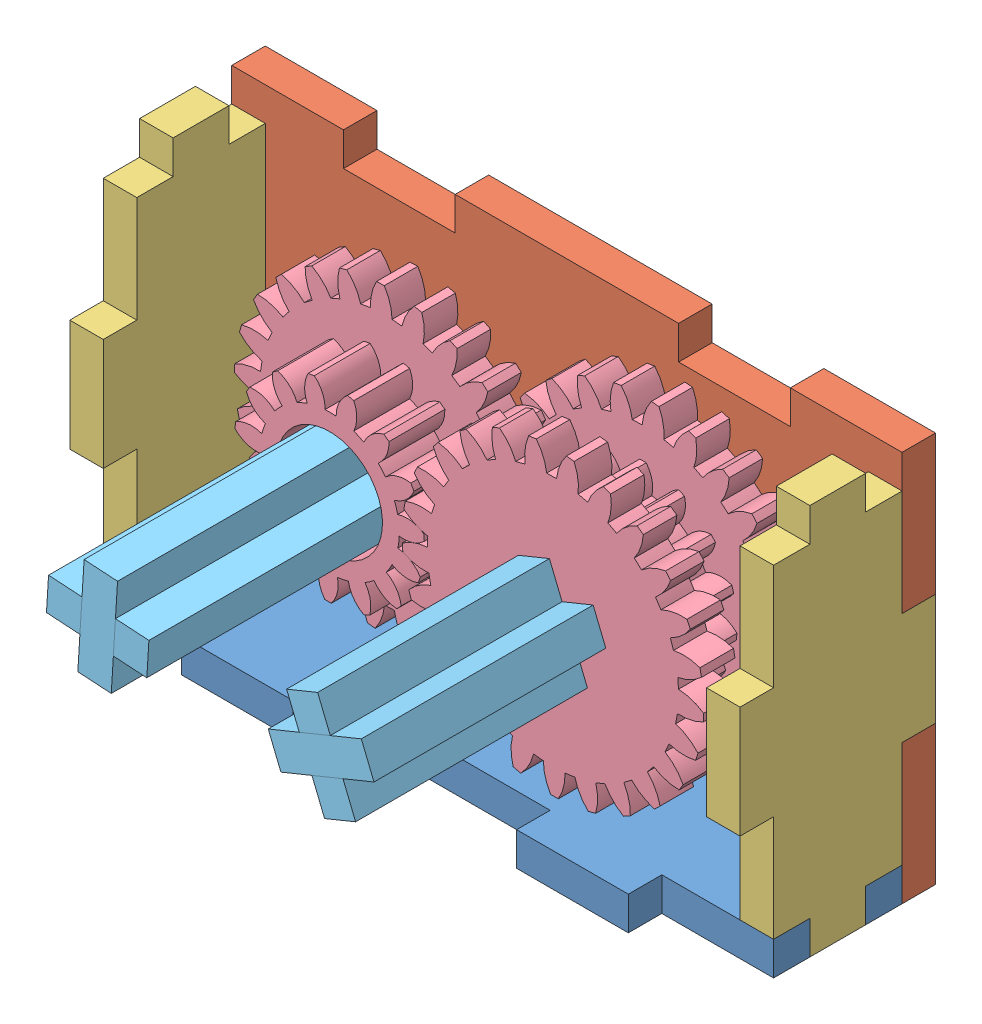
SolidWorks assembly Ensamblaje1.SLDASM, configuration Predeterminado (file format 10000). Lengths in mm.
Overall size (60 38.26 40).
18 component instances, 5 part files, 34 mates.
Components (placement in the parent):
- base-1: base.SLDPRT [Predeterminado] at (-76.0453 8.4398 111) size (60 3 17.5)
- TapaTrasera-1: TapaTrasera.SLDPRT [Predeterminado] at (-76.0453 25.9398 100) size (60 35 3)
- TapaTrasera-2: TapaTrasera.SLDPRT [Predeterminado] at (-76.0453 25.9398 114.5) size (60 35 3) (hidden)
- lateral-2: lateral.SLDPRT [Predeterminado] at (-46.0453 79.842 162.6577) x (0 0 -1) z (-1 0 0) size (17.5 35 3)
- lateral-3: lateral.SLDPRT [Predeterminado] at (-103.0453 79.842 162.6577) x (0 0 -1) z (-1 0 0) size (17.5 35 3)
- EngranajeParametrico-1: EngranajeParametrico.SLDPRT [15_cruz] at (-86.0453 25.9398 106.25) x (-0.998034 0.06267 0) z (-0.06267 -0.998034 0) size (16.96 3 16.87)
- EngranajeParametrico-6: EngranajeParametrico.SLDPRT [25_cruz] at (-66.0453 25.9398 111.25) x (-0.925852 -0.377887 0) z (-0.377887 0.925852 0) size (26.98 3 26.93)
- eje-1: eje.SLDPRT [Predeterminado] at (-65.4785 24.551 115) x (0 0 -1) z (-0.377887 0.925852 0) size (40 9 3)
- eje-2: eje.SLDPRT [Predeterminado] at (-67.4341 25.3729 115) x (0 0 1) z (0.925852 0.377887 0) size (40 9 3)
- eje-3: eje.SLDPRT [Predeterminado] at (-86.1393 24.4427 115) x (0 0 1) z (0.06267 0.998034 0) size (40 9 3)
- eje-4: eje.SLDPRT [Predeterminado] at (-84.5483 25.8457 115) x (0 0 -1) z (-0.998034 0.06267 0) size (40 9 3)
- base-2: base.SLDPRT [Predeterminado] at (-76.0453 40.4398 111) size (60 3 17.5) (hidden)
- SubEnsambleEngranaje-1: SubEnsambleEngranaje.SLDASM [Predeterminado] at (-95.6579 0.4944 104.3797) x (-0.974851 0.222856 0) z (0.222856 0.974851 0) size (37.25 8 37.26)
  - EngranajeParametrico-1: EngranajeParametrico.SLDPRT [15_interior_circulo] at (-3.7001 1.8703 26.9476) size (16.96 8 16.87)
  - EngranajeParametrico-2: EngranajeParametrico.SLDPRT [25_exterior] at (-3.7001 1.8703 26.9476) x (0.540996 0 0.841025) z (-0.841025 0 0.540996) size (26.98 3 26.93)
- SubEnsambleEngranaje-2: SubEnsambleEngranaje.SLDASM [Predeterminado] at (-88.6648 10.8327 101.3797) x (-0.663357 0.748303 0) z (0.748303 0.663357 0) size (37.25 8 37.26)
  - EngranajeParametrico-1: EngranajeParametrico.SLDPRT [15_interior_circulo] at (-3.7001 1.8703 26.9476) size (16.96 8 16.87)
  - EngranajeParametrico-2: EngranajeParametrico.SLDPRT [25_exterior] at (-3.7001 1.8703 26.9476) x (0.540996 0 0.841025) z (-0.841025 0 0.540996) size (26.98 3 26.93)
Mates (geometry in assembly coordinates):
- Coincidente8: coincident: line of base-1 through (-46.0453 8.4398 103) axis (-1 0 0); line of TapaTrasera-1 through (-56.0453 8.4398 103) axis (1 0 0)
- Coincidente11: coincident: line of base-1 through (-46.0453 8.4398 114.5) axis (0 0 -1); line of TapaTrasera-2 through (-46.0453 8.4398 117.5) axis (0 0 -1)
- Coincidente13: coincident: line of base-1 through (-46.0453 11.4398 103) axis (0 -1 0); line of TapaTrasera-1 through (-46.0453 8.4398 103) axis (0 1 0)
- Paralelo1: parallel: plane of TapaTrasera-1 through (-46.0453 8.4398 103) normal (1 0 0); plane of lateral-2 through (-49.0453 79.842 162.6577) normal (-1 0 0)
- Coincidente17: coincident: line of TapaTrasera-2 through (-46.0453 30.9398 117.5) axis (0 1 0); line of lateral-2 through (-46.0453 20.9398 117.5) axis (0 1 0)
- Coincidente18: coincident: line of base-1 through (-103.0453 8.4398 111.25) axis (0 0 -1); line of lateral-3 through (-103.0453 8.4398 106.25) axis (0 0 1)
- Concéntrica1: concentric: cylinder of TapaTrasera-1 through (-86.0453 25.9398 103) axis (0 0 -1) radius 4.75; cylinder of EngranajeParametrico-1 through (-86.0453 25.9398 110.2313) axis (0 0 -1) radius 6.25
- Coincidente28: coincident: line of base-1 through (-106.0453 8.4398 103) axis (0 0 1); line of lateral-3 through (-106.0453 8.4398 106.25) axis (0 0 1)
- Coincidente29: coincident: line of TapaTrasera-1 through (-106.0453 43.4398 100) axis (0 -1 0); line of lateral-3 through (-106.0453 30.9398 100) axis (0 -1 0)
- Coincidente37: coincident: line of base-1 through (-96.0453 8.4398 117.5) axis (1 0 0); line of TapaTrasera-2 through (-86.0453 8.4398 117.5) axis (1 0 0)
- Coincidente42: coincident: plane of eje-1 through (-56.4474 6.3936 115) normal (0 0 -1); plane of eje-2 through (-86.7251 19.1194 115) normal (0 0 1)
- Coincidente43: coincident: line of eje-1 through (-68.001 26.7617 115) axis (0.925852 0.377887 0); line of eje-2 through (-68.001 26.7617 115) axis (0.925852 0.377887 0)
- Coincidente44: coincident: line of eje-1 through (-66.8673 23.9841 115) axis (-0.377887 0.925852 0); line of eje-2 through (-68.001 26.7617 115) axis (0.377887 -0.925852 0)
- Coincidente47: coincident: line of EngranajeParametrico-6 through (-61.3122 26.2515 111.25) axis (0 0 1); line of eje-1 through (-61.3122 26.2515 135) axis (0 0 -1)
- Coincidente48: coincident: line of EngranajeParametrico-6 through (-66.3571 30.6729 111.25) axis (0 0 1); line of eje-2 through (-66.3571 30.6729 95) axis (0 0 1)
- Coincidente49: coincident: line of eje-3 through (-84.4543 27.3428 115) axis (-0.998034 0.06267 0); line of eje-4 through (-84.4543 27.3428 115) axis (-0.998034 0.06267 0)
- Coincidente50: coincident: line of eje-3 through (-84.6423 24.3487 115) axis (0.06267 0.998034 0); line of eje-4 through (-84.4543 27.3428 115) axis (-0.06267 -0.998034 0)
- Coincidente51: coincident: line of EngranajeParametrico-1 through (-84.8303 21.3546 106.25) axis (0 0 -1); line of eje-4 through (-84.8303 21.3546 95) axis (0 0 1)
- Coincidente52: coincident: line of EngranajeParametrico-1 through (-87.8244 21.5426 106.25) axis (0 0 -1); line of eje-4 through (-87.8244 21.5426 95) axis (0 0 1)
- Distancia1: distance = 5 mm: plane of eje-3 through (-90.4425 27.7188 95) normal (0 0 -1); plane of TapaTrasera-1 through (-76.0453 25.9398 100) normal (0 0 -1)
- Distancia2: distance = 5 mm: plane of eje-2 through (-66.3571 30.6729 95) normal (0 0 -1); plane of TapaTrasera-1 through (-76.0453 25.9398 100) normal (0 0 -1)
- Coincidente55: coincident: line of TapaTrasera-2 through (-96.0453 40.4398 117.5) axis (1 0 0); line of base-2 through (-96.0453 40.4398 117.5) axis (1 0 0)
- Coincidente56: coincident: line of lateral-3 through (-106.0453 40.4398 106.25) axis (0 0 -1); line of base-2 through (-106.0453 40.4398 103) axis (0 0 1)
- Coincidente57: coincident: line of TapaTrasera-1 through (-46.0453 8.4398 103) axis (0 0 -1); line of lateral-2 through (-46.0453 8.4398 106.25) axis (0 0 1)
- Coincidente61: coincident: plane of EngranajeParametrico-6 through (-66.0453 25.9398 111.25) normal (0 0 -1); plane of SubEnsambleEngranaje-2/EngranajeParametrico-1 through (-66.0453 25.9398 111.25) normal (0 0 1)
- Concéntrica2: concentric: cylinder of EngranajeParametrico-6 through (-66.0453 25.9398 107.588) axis (0 0 1) radius 11.25; cylinder of SubEnsambleEngranaje-2/EngranajeParametrico-1 through (-66.0453 25.9398 89.8336) axis (0 0 1) radius 4.7434
- Concéntrica3: concentric: cylinder of EngranajeParametrico-1 through (-86.0453 25.9398 110.2313) axis (0 0 -1) radius 6.25; cylinder of SubEnsambleEngranaje-1/EngranajeParametrico-1 through (-86.0453 25.9398 92.8336) axis (0 0 1) radius 4.7434
- Coincidente62: coincident: plane of EngranajeParametrico-1 through (-86.0453 25.9398 106.25) normal (0 0 1); plane of SubEnsambleEngranaje-1/EngranajeParametrico-2 through (-86.0453 25.9398 106.25) normal (0 0 -1)
- Concéntrica4: concentric: circle of TapaTrasera-1; circle of SubEnsambleEngranaje-2/EngranajeParametrico-1
- Coincidente63: coincident: plane of EngranajeParametrico-1 through (-86.0453 25.9398 103.25) normal (0 0 -1); plane of SubEnsambleEngranaje-2/EngranajeParametrico-2 through (-66.0453 25.9398 103.25) normal (0 0 -1)
- Ancho1: width: plane of TapaTrasera-2 through (-76.0453 25.9398 114.5) normal (0 0 -1); plane of TapaTrasera-1 through (-76.0453 25.9398 103) normal (0 0 1); plane of EngranajeParametrico-6 through (-66.0453 25.9398 114.25) normal (0 0 1); plane of SubEnsambleEngranaje-2/EngranajeParametrico-2 through (-66.0453 25.9398 103.25) normal (0 0 -1)
- Relación de posición de engranaje1: gear = 25 mm: circle of EngranajeParametrico-1; circle of SubEnsambleEngranaje-2/EngranajeParametrico-2
- Relación de posición de engranaje2: gear = 25 mm: cylinder of SubEnsambleEngranaje-2/EngranajeParametrico-1 through (-66.0453 25.9398 99.1792) axis (0 0 1) radius 6.25; cylinder of SubEnsambleEngranaje-1/EngranajeParametrico-2 through (-86.0453 25.9398 102.364) axis (0 0 1) radius 11.25
- Relación de posición de engranaje4: gear = 25 mm: circle of SubEnsambleEngranaje-1/EngranajeParametrico-1; circle of EngranajeParametrico-6
